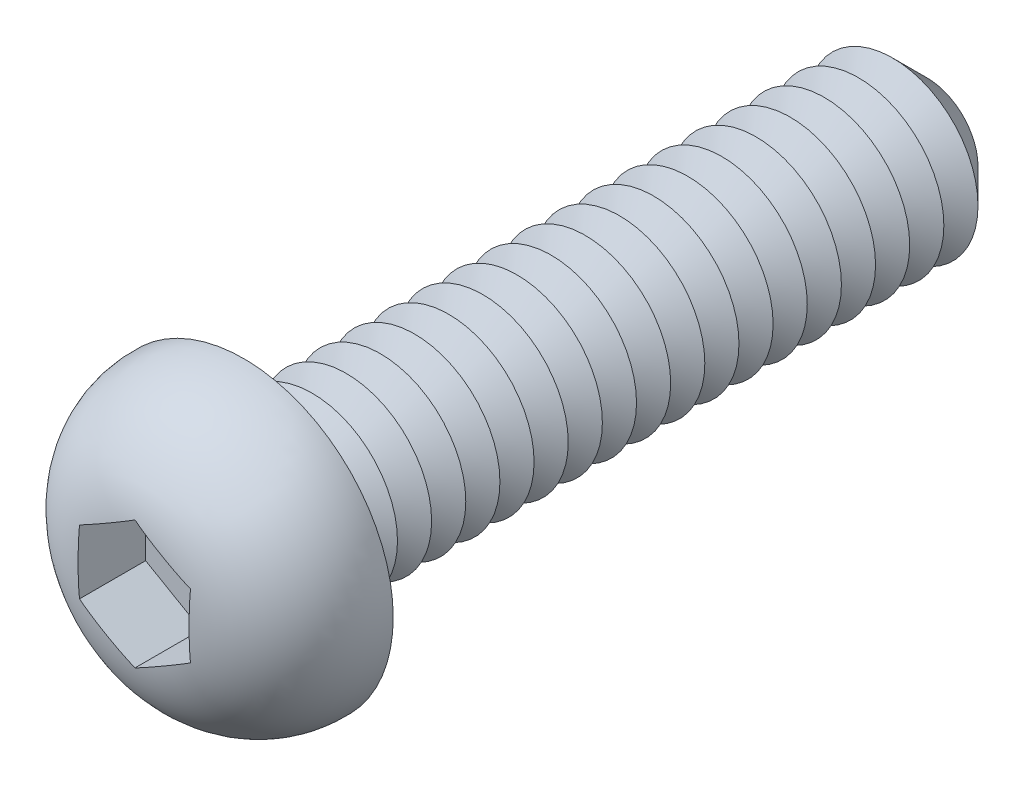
from build123d import *

# Parameters (mm, degrees)
CUT_EXTRUDE1_DEPTH  = 0.8
SKETCH4_R           = 1
BOSS_EXTRUDE1_DEPTH = 8
CHAMFER1_SIZE       = 0.4
LPATTERN1_COUNT     = 18
LPATTERN1_PITCH     = 0.4
FILLET2_R           = 0.2
SKETCH6_R           = 0.35
CUT_EXTRUDE2_DEPTH  = 8.5


with BuildPart() as part:
    # Sketch2 → Revolve1 (revolve)
    with BuildSketch(Plane(origin=(0, 0, 0), x_dir=(0, 0, -1), z_dir=(1, 0, 0)), mode=Mode.PRIVATE) as revolve1_sk:
        with BuildLine():
            Line((0, 0), (-1.3, 0))
            Line((-1.3, 0), (-1.3, 0.5010004))
            ThreePointArc((-1.3, 0.5010004), (-0.916025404, 1.402388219), (0, 1.75))
            Line((0, 1.75), (0, 0))
        make_face()
    revolve(revolve1_sk.sketch.rotate(Axis((0, 0, 47.934239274), (0, 0, -1)), 90), axis=Axis((0, 0, 47.934239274), (0, 0, -1)))

    # Sketch3 → Cut-Extrude1 (cut)
    with BuildSketch(Plane.XY.offset(1.3)):
        Polygon((0, 0.75055535), (-0.65, 0.375277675), (-0.65, -0.375277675), (0, -0.75055535), (0.65, -0.375277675), (0.65, 0.375277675), align=None)
    extrude(amount=-CUT_EXTRUDE1_DEPTH, mode=Mode.SUBTRACT)

    # Sketch4 → Boss-Extrude1 (add)
    with BuildSketch(Plane(origin=(0, 0, 0), x_dir=(-1, 0, 0), z_dir=(0, 0, -1))):
        Circle(SKETCH4_R)
    extrude(amount=BOSS_EXTRUDE1_DEPTH)

    # Chamfer1
    chamfer1_edges = [part.edges().sort_by_distance(p)[0] for p in [
        (1, 0, -8),
    ]]
    chamfer(chamfer1_edges, length=CHAMFER1_SIZE)

    # Sketch5 → Cut-Revolve1 (revolve, cut)
    with BuildSketch(Plane(origin=(0, 0, 0), x_dir=(0, 0, -1), z_dir=(1, 0, 0)), mode=Mode.PRIVATE) as cut_revolve1_sk:
        Polygon((0.4, 1), (0.8, 1), (0.6, 0.653589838), align=None)
    cut_revolve1 = revolve(cut_revolve1_sk.sketch.rotate(Axis((0, 0, 47.934239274), (0, 0, -1)), 90), axis=Axis((0, 0, 47.934239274), (0, 0, -1)), mode=Mode.SUBTRACT)

    # LPattern1: Cut-Revolve1 ×18
    with Locations(*[(0, 0, -i * LPATTERN1_PITCH) for i in range(1, LPATTERN1_COUNT)]):
        add(cut_revolve1, mode=Mode.SUBTRACT)

    # Fillet2
    fillet2_edges = [part.edges().sort_by_distance(p)[0] for p in [
        (1, 0, 0),
    ]]
    fillet(fillet2_edges, radius=FILLET2_R)

    # Sketch6 → Cut-Extrude2 (cut)
    with BuildSketch(Plane.XY.offset(0.5)):
        Circle(SKETCH6_R)
    extrude(amount=-CUT_EXTRUDE2_DEPTH, mode=Mode.SUBTRACT)


solid = part.part
